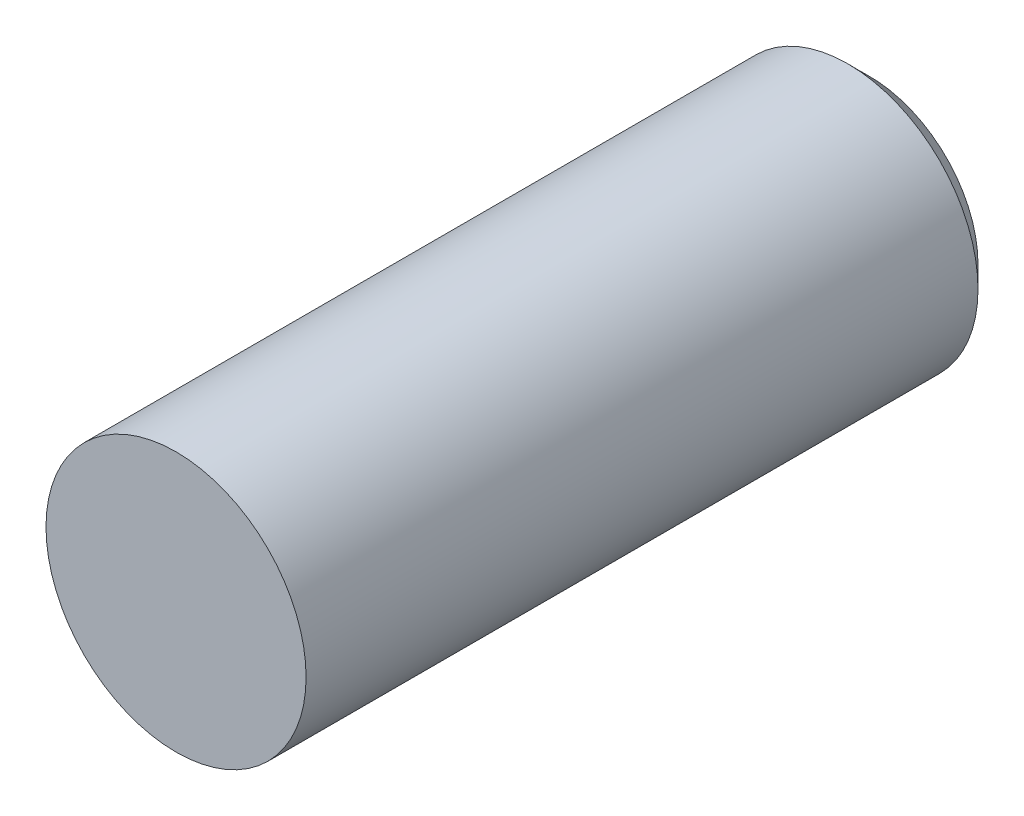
from build123d import *

# Parameters (mm, degrees)
SKETCH1_R           = 1.5
BOSS_EXTRUDE1_DEPTH = 8
CHAMFER1_SIZE       = 0.25


with BuildPart() as part:
    # Sketch1 → Boss-Extrude1 (new body)
    with BuildSketch(Plane(origin=(0, 0, 0), x_dir=(0, 1, 0), z_dir=(0, 0, 1))):
        with Locations(Location((0, 0, 0), (0, 0, 270))):
            Circle(SKETCH1_R)
    extrude(amount=BOSS_EXTRUDE1_DEPTH)

    # Chamfer1
    chamfer1_edges = [part.edges().sort_by_distance(p)[0] for p in [
        (-1.5, 0, 0),
    ]]
    chamfer(chamfer1_edges, length=CHAMFER1_SIZE)


solid = part.part
